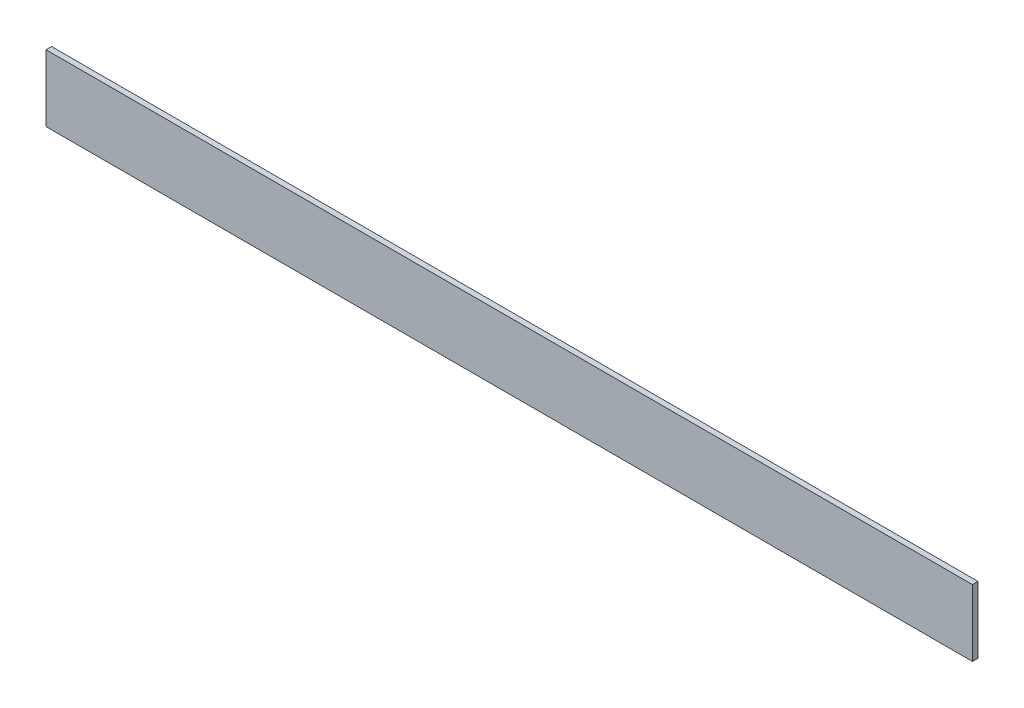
ISO-10303-21;
HEADER;
FILE_DESCRIPTION(('STEP AP214'),'2;1');
FILE_NAME('part.step','',(''),(''),'','','');
FILE_SCHEMA(('AUTOMOTIVE_DESIGN { 1 0 10303 214 1 1 1 1 }'));
ENDSEC;
DATA;
#1=APPLICATION_CONTEXT('core data for automotive mechanical design processes');
#2=APPLICATION_PROTOCOL_DEFINITION('international standard','automotive_design',2000,#1);
#3=PRODUCT_CONTEXT('',#1,'mechanical');
#4=PRODUCT('Part','Part','',(#3));
#5=PRODUCT_RELATED_PRODUCT_CATEGORY('part','',(#4));
#6=PRODUCT_DEFINITION_FORMATION('','',#4);
#7=PRODUCT_DEFINITION_CONTEXT('part definition',#1,'design');
#8=PRODUCT_DEFINITION('design','',#6,#7);
#9=PRODUCT_DEFINITION_SHAPE('','',#8);
#10=(LENGTH_UNIT() NAMED_UNIT(*) SI_UNIT(.MILLI.,.METRE.));
#11=(NAMED_UNIT(*) PLANE_ANGLE_UNIT() SI_UNIT($,.RADIAN.));
#12=(NAMED_UNIT(*) SI_UNIT($,.STERADIAN.) SOLID_ANGLE_UNIT());
#13=UNCERTAINTY_MEASURE_WITH_UNIT(LENGTH_MEASURE(1.E-05),#10,'distance_accuracy_value','');
#14=(GEOMETRIC_REPRESENTATION_CONTEXT(3) GLOBAL_UNCERTAINTY_ASSIGNED_CONTEXT((#13)) GLOBAL_UNIT_ASSIGNED_CONTEXT((#10,
#11,#12)) REPRESENTATION_CONTEXT('',''));
#15=CARTESIAN_POINT('',(0.,0.,0.));
#16=DIRECTION('',(0.,0.,1.));
#17=DIRECTION('',(1.,0.,0.));
#18=AXIS2_PLACEMENT_3D('',#15,#16,#17);
#19=CARTESIAN_POINT('',(530.225,-38.1,6.35));
#20=DIRECTION('',(-1.,0.,0.));
#21=DIRECTION('',(0.,0.,1.));
#22=AXIS2_PLACEMENT_3D('',#19,#20,#21);
#23=PLANE('',#22);
#24=DIRECTION('',(0.,1.,0.));
#25=VECTOR('',#24,1.);
#26=CARTESIAN_POINT('',(530.225,-38.1,0.));
#27=LINE('',#26,#25);
#28=CARTESIAN_POINT('',(530.225,-38.1,0.));
#29=VERTEX_POINT('',#28);
#30=CARTESIAN_POINT('',(530.225,38.1,0.));
#31=VERTEX_POINT('',#30);
#32=EDGE_CURVE('E114',#29,#31,#27,.T.);
#33=ORIENTED_EDGE('',*,*,#32,.T.);
#34=DIRECTION('',(0.,0.,-1.));
#35=VECTOR('',#34,1.);
#36=CARTESIAN_POINT('',(530.225,38.1,6.35));
#37=LINE('',#36,#35);
#38=CARTESIAN_POINT('',(530.225,38.1,6.35));
#39=VERTEX_POINT('',#38);
#40=EDGE_CURVE('E11',#39,#31,#37,.T.);
#41=ORIENTED_EDGE('',*,*,#40,.F.);
#42=DIRECTION('',(0.,1.,0.));
#43=VECTOR('',#42,1.);
#44=CARTESIAN_POINT('',(530.225,-38.1,6.35));
#45=LINE('',#44,#43);
#46=CARTESIAN_POINT('',(530.225,-38.1,6.35));
#47=VERTEX_POINT('',#46);
#48=EDGE_CURVE('E96',#47,#39,#45,.T.);
#49=ORIENTED_EDGE('',*,*,#48,.F.);
#50=DIRECTION('',(0.,0.,-1.));
#51=VECTOR('',#50,1.);
#52=CARTESIAN_POINT('',(530.225,-38.1,6.35));
#53=LINE('',#52,#51);
#54=EDGE_CURVE('E110',#47,#29,#53,.T.);
#55=ORIENTED_EDGE('',*,*,#54,.T.);
#56=EDGE_LOOP('',(#33,#41,#49,#55));
#57=FACE_BOUND('',#56,.T.);
#58=ADVANCED_FACE('F41',(#57),#23,.F.);
#59=CARTESIAN_POINT('',(-530.225,38.1,6.35));
#60=DIRECTION('',(0.,-1.,0.));
#61=DIRECTION('',(0.,0.,-1.));
#62=AXIS2_PLACEMENT_3D('',#59,#60,#61);
#63=PLANE('',#62);
#64=DIRECTION('',(-1.,0.,0.));
#65=VECTOR('',#64,1.);
#66=CARTESIAN_POINT('',(-530.225,38.1,0.));
#67=LINE('',#66,#65);
#68=CARTESIAN_POINT('',(-530.225,38.1,0.));
#69=VERTEX_POINT('',#68);
#70=EDGE_CURVE('E101',#31,#69,#67,.T.);
#71=ORIENTED_EDGE('',*,*,#70,.T.);
#72=DIRECTION('',(0.,0.,-1.));
#73=VECTOR('',#72,1.);
#74=CARTESIAN_POINT('',(-530.225,38.1,6.35));
#75=LINE('',#74,#73);
#76=CARTESIAN_POINT('',(-530.225,38.1,6.35));
#77=VERTEX_POINT('',#76);
#78=EDGE_CURVE('E49',#77,#69,#75,.T.);
#79=ORIENTED_EDGE('',*,*,#78,.F.);
#80=DIRECTION('',(-1.,0.,0.));
#81=VECTOR('',#80,1.);
#82=CARTESIAN_POINT('',(-530.225,38.1,6.35));
#83=LINE('',#82,#81);
#84=EDGE_CURVE('E91',#39,#77,#83,.T.);
#85=ORIENTED_EDGE('',*,*,#84,.F.);
#86=ORIENTED_EDGE('',*,*,#40,.T.);
#87=EDGE_LOOP('',(#71,#79,#85,#86));
#88=FACE_BOUND('',#87,.T.);
#89=ADVANCED_FACE('F100',(#88),#63,.F.);
#90=CARTESIAN_POINT('',(-530.225,-38.1,6.35));
#91=DIRECTION('',(1.,0.,0.));
#92=DIRECTION('',(0.,0.,-1.));
#93=AXIS2_PLACEMENT_3D('',#90,#91,#92);
#94=PLANE('',#93);
#95=DIRECTION('',(0.,-1.,0.));
#96=VECTOR('',#95,1.);
#97=CARTESIAN_POINT('',(-530.225,-38.1,0.));
#98=LINE('',#97,#96);
#99=CARTESIAN_POINT('',(-530.225,-38.1,0.));
#100=VERTEX_POINT('',#99);
#101=EDGE_CURVE('E78',#69,#100,#98,.T.);
#102=ORIENTED_EDGE('',*,*,#101,.T.);
#103=DIRECTION('',(0.,0.,-1.));
#104=VECTOR('',#103,1.);
#105=CARTESIAN_POINT('',(-530.225,-38.1,6.35));
#106=LINE('',#105,#104);
#107=CARTESIAN_POINT('',(-530.225,-38.1,6.35));
#108=VERTEX_POINT('',#107);
#109=EDGE_CURVE('E103',#108,#100,#106,.T.);
#110=ORIENTED_EDGE('',*,*,#109,.F.);
#111=DIRECTION('',(0.,-1.,0.));
#112=VECTOR('',#111,1.);
#113=CARTESIAN_POINT('',(-530.225,-38.1,6.35));
#114=LINE('',#113,#112);
#115=EDGE_CURVE('E94',#77,#108,#114,.T.);
#116=ORIENTED_EDGE('',*,*,#115,.F.);
#117=ORIENTED_EDGE('',*,*,#78,.T.);
#118=EDGE_LOOP('',(#102,#110,#116,#117));
#119=FACE_BOUND('',#118,.T.);
#120=ADVANCED_FACE('F104',(#119),#94,.F.);
#121=CARTESIAN_POINT('',(-530.225,-38.1,6.35));
#122=DIRECTION('',(0.,1.,0.));
#123=DIRECTION('',(0.,0.,1.));
#124=AXIS2_PLACEMENT_3D('',#121,#122,#123);
#125=PLANE('',#124);
#126=DIRECTION('',(1.,0.,0.));
#127=VECTOR('',#126,1.);
#128=CARTESIAN_POINT('',(-530.225,-38.1,0.));
#129=LINE('',#128,#127);
#130=EDGE_CURVE('E84',#100,#29,#129,.T.);
#131=ORIENTED_EDGE('',*,*,#130,.T.);
#132=ORIENTED_EDGE('',*,*,#54,.F.);
#133=DIRECTION('',(1.,0.,0.));
#134=VECTOR('',#133,1.);
#135=CARTESIAN_POINT('',(-530.225,-38.1,6.35));
#136=LINE('',#135,#134);
#137=EDGE_CURVE('E57',#108,#47,#136,.T.);
#138=ORIENTED_EDGE('',*,*,#137,.F.);
#139=ORIENTED_EDGE('',*,*,#109,.T.);
#140=EDGE_LOOP('',(#131,#132,#138,#139));
#141=FACE_BOUND('',#140,.T.);
#142=ADVANCED_FACE('F123',(#141),#125,.F.);
#143=CARTESIAN_POINT('',(0.,0.,6.35));
#144=DIRECTION('',(0.,0.,-1.));
#145=DIRECTION('',(-1.,0.,0.));
#146=AXIS2_PLACEMENT_3D('',#143,#144,#145);
#147=PLANE('',#146);
#148=ORIENTED_EDGE('',*,*,#48,.T.);
#149=ORIENTED_EDGE('',*,*,#84,.T.);
#150=ORIENTED_EDGE('',*,*,#115,.T.);
#151=ORIENTED_EDGE('',*,*,#137,.T.);
#152=EDGE_LOOP('',(#148,#149,#150,#151));
#153=FACE_BOUND('',#152,.T.);
#154=ADVANCED_FACE('F92',(#153),#147,.F.);
#155=CARTESIAN_POINT('',(0.,0.,0.));
#156=DIRECTION('',(0.,0.,-1.));
#157=DIRECTION('',(-1.,0.,0.));
#158=AXIS2_PLACEMENT_3D('',#155,#156,#157);
#159=PLANE('',#158);
#160=ORIENTED_EDGE('',*,*,#32,.F.);
#161=ORIENTED_EDGE('',*,*,#130,.F.);
#162=ORIENTED_EDGE('',*,*,#101,.F.);
#163=ORIENTED_EDGE('',*,*,#70,.F.);
#164=EDGE_LOOP('',(#160,#161,#162,#163));
#165=FACE_BOUND('',#164,.T.);
#166=ADVANCED_FACE('F126',(#165),#159,.T.);
#167=CLOSED_SHELL('',(#58,#89,#120,#142,#154,#166));
#168=MANIFOLD_SOLID_BREP('B2',#167);
#169=ADVANCED_BREP_SHAPE_REPRESENTATION('',(#18,#168),#14);
#170=SHAPE_DEFINITION_REPRESENTATION(#9,#169);
ENDSEC;
END-ISO-10303-21;
